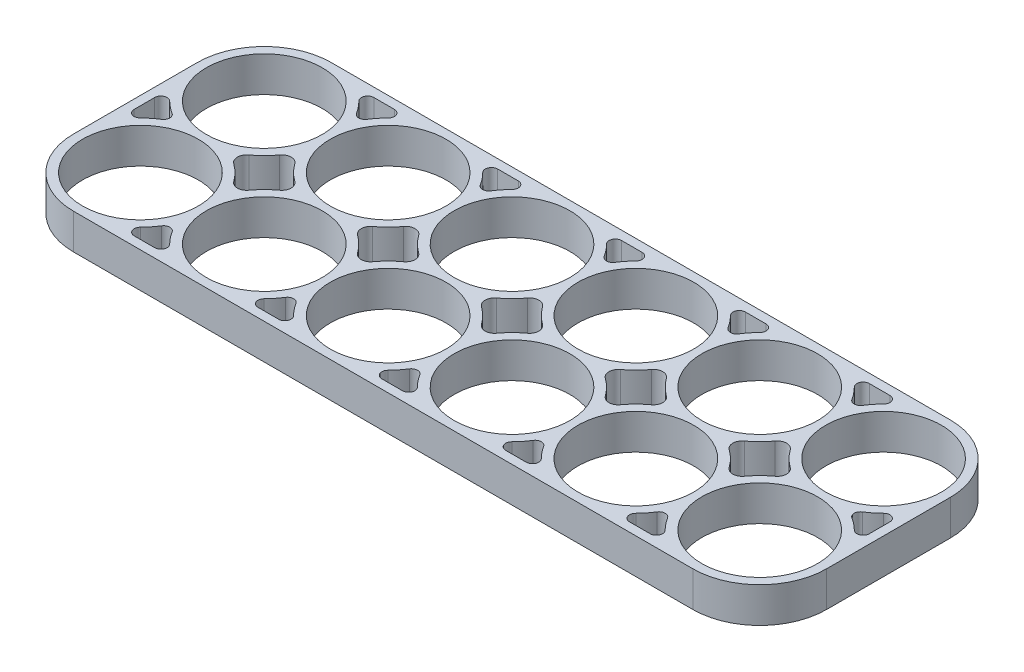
from build123d import *

# Parameters (mm, degrees)
SKIZZE1_R                       = 9.35
AUFSATZ_LINEAR_AUSTRAGEN1_DEPTH = 5.7


with BuildPart() as part:
    # Skizze1 → Aufsatz-Linear austragen1 (new body)
    with BuildSketch(Plane(origin=(0, 0, 0), x_dir=(1, 0, 0), z_dir=(0, 1, 0))):
        with BuildLine():
            Line((-60.8, 10), (-60.8, -10))
            ThreePointArc((-60.8, -10), (-57.636753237, -17.636753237), (-50, -20.8))
            Line((-50, -20.8), (50, -20.8))
            ThreePointArc((50, -20.8), (57.636753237, -17.636753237), (60.8, -10))
            Line((60.8, -10), (60.8, 10))
            ThreePointArc((60.8, 10), (57.636753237, 17.636753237), (50, 20.8))
            Line((50, 20.8), (-50, 20.8))
            ThreePointArc((-50, 20.8), (-57.636753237, 17.636753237), (-60.8, 10))
        make_face()
        with Locations(Location((-50, 10, 0), (0, 0, 270))):
            Circle(SKIZZE1_R, mode=Mode.SUBTRACT)
        with Locations(Location((-30, 10, 0), (0, 0, 270))):
            Circle(SKIZZE1_R, mode=Mode.SUBTRACT)
        with Locations(Location((-10, 10, 0), (0, 0, 270))):
            Circle(SKIZZE1_R, mode=Mode.SUBTRACT)
        with Locations(Location((10, 10, 0), (0, 0, 270))):
            Circle(SKIZZE1_R, mode=Mode.SUBTRACT)
        with Locations(Location((30, 10, 0), (0, 0, 270))):
            Circle(SKIZZE1_R, mode=Mode.SUBTRACT)
        with Locations(Location((50, 10, 0), (0, 0, 270))):
            Circle(SKIZZE1_R, mode=Mode.SUBTRACT)
        with Locations(Location((50, -10, 0), (0, 0, 270))):
            Circle(SKIZZE1_R, mode=Mode.SUBTRACT)
        with Locations(Location((30, -10, 0), (0, 0, 270))):
            Circle(SKIZZE1_R, mode=Mode.SUBTRACT)
        with Locations(Location((10, -10, 0), (0, 0, 270))):
            Circle(SKIZZE1_R, mode=Mode.SUBTRACT)
        with Locations(Location((-10, -10, 0), (0, 0, 270))):
            Circle(SKIZZE1_R, mode=Mode.SUBTRACT)
        with Locations(Location((-30, -10, 0), (0, 0, 270))):
            Circle(SKIZZE1_R, mode=Mode.SUBTRACT)
        with Locations(Location((-50, -10, 0), (0, 0, 270))):
            Circle(SKIZZE1_R, mode=Mode.SUBTRACT)
        with BuildLine():
            Line((-21.662284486, -19.35), (-18.337715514, -19.35))
            ThreePointArc((-18.337715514, -19.35), (-17.41369519, -18.732343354), (-17.631129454, -17.642372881))
            ThreePointArc((-17.631129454, -17.642372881), (-18.445947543, -16.730970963), (-19.152542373, -15.733320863))
            ThreePointArc((-19.152542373, -15.733320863), (-20, -15.264183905), (-20.847457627, -15.733320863))
            ThreePointArc((-20.847457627, -15.733320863), (-21.554052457, -16.730970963), (-22.368870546, -17.642372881))
            ThreePointArc((-22.368870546, -17.642372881), (-22.58630481, -18.732343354), (-21.662284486, -19.35))
        make_face(mode=Mode.SUBTRACT)
        with BuildLine():
            Line((-1.662284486, -19.35), (1.662284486, -19.35))
            ThreePointArc((1.662284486, -19.35), (2.58630481, -18.732343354), (2.368870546, -17.642372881))
            ThreePointArc((2.368870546, -17.642372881), (1.554052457, -16.730970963), (0.847457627, -15.733320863))
            ThreePointArc((0.847457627, -15.733320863), (0, -15.264183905), (-0.847457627, -15.733320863))
            ThreePointArc((-0.847457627, -15.733320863), (-1.554052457, -16.730970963), (-2.368870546, -17.642372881))
            ThreePointArc((-2.368870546, -17.642372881), (-2.58630481, -18.732343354), (-1.662284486, -19.35))
        make_face(mode=Mode.SUBTRACT)
        with BuildLine():
            Line((-59.35, -1.662284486), (-59.35, 1.662284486))
            ThreePointArc((-59.35, 1.662284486), (-58.732343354, 2.58630481), (-57.642372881, 2.368870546))
            ThreePointArc((-57.642372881, 2.368870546), (-56.730970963, 1.554052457), (-55.733320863, 0.847457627))
            ThreePointArc((-55.733320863, 0.847457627), (-55.264183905, 0), (-55.733320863, -0.847457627))
            ThreePointArc((-55.733320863, -0.847457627), (-56.730970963, -1.554052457), (-57.642372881, -2.368870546))
            ThreePointArc((-57.642372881, -2.368870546), (-58.732343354, -2.58630481), (-59.35, -1.662284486))
        make_face(mode=Mode.SUBTRACT)
        with BuildLine():
            Line((-41.662284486, -19.35), (-38.337715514, -19.35))
            ThreePointArc((-38.337715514, -19.35), (-37.41369519, -18.732343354), (-37.631129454, -17.642372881))
            ThreePointArc((-37.631129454, -17.642372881), (-38.445947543, -16.730970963), (-39.152542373, -15.733320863))
            ThreePointArc((-39.152542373, -15.733320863), (-40, -15.264183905), (-40.847457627, -15.733320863))
            ThreePointArc((-40.847457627, -15.733320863), (-41.554052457, -16.730970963), (-42.368870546, -17.642372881))
            ThreePointArc((-42.368870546, -17.642372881), (-42.58630481, -18.732343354), (-41.662284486, -19.35))
        make_face(mode=Mode.SUBTRACT)
        with BuildLine():
            Line((18.337715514, -19.35), (21.662284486, -19.35))
            ThreePointArc((21.662284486, -19.35), (22.58630481, -18.732343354), (22.368870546, -17.642372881))
            ThreePointArc((22.368870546, -17.642372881), (21.554052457, -16.730970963), (20.847457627, -15.733320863))
            ThreePointArc((20.847457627, -15.733320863), (20, -15.264183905), (19.152542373, -15.733320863))
            ThreePointArc((19.152542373, -15.733320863), (18.445947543, -16.730970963), (17.631129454, -17.642372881))
            ThreePointArc((17.631129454, -17.642372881), (17.41369519, -18.732343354), (18.337715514, -19.35))
        make_face(mode=Mode.SUBTRACT)
        with BuildLine():
            Line((38.337715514, -19.35), (41.662284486, -19.35))
            ThreePointArc((41.662284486, -19.35), (42.58630481, -18.732343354), (42.368870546, -17.642372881))
            ThreePointArc((42.368870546, -17.642372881), (41.554052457, -16.730970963), (40.847457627, -15.733320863))
            ThreePointArc((40.847457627, -15.733320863), (40, -15.264183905), (39.152542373, -15.733320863))
            ThreePointArc((39.152542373, -15.733320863), (38.445947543, -16.730970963), (37.631129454, -17.642372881))
            ThreePointArc((37.631129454, -17.642372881), (37.41369519, -18.732343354), (38.337715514, -19.35))
        make_face(mode=Mode.SUBTRACT)
        with BuildLine():
            Line((59.35, -1.662284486), (59.35, 1.662284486))
            ThreePointArc((59.35, 1.662284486), (58.732343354, 2.58630481), (57.642372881, 2.368870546))
            ThreePointArc((57.642372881, 2.368870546), (56.730970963, 1.554052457), (55.733320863, 0.847457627))
            ThreePointArc((55.733320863, 0.847457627), (55.264183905, 0), (55.733320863, -0.847457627))
            ThreePointArc((55.733320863, -0.847457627), (56.730970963, -1.554052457), (57.642372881, -2.368870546))
            ThreePointArc((57.642372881, -2.368870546), (58.732343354, -2.58630481), (59.35, -1.662284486))
        make_face(mode=Mode.SUBTRACT)
        with BuildLine():
            Line((-41.662284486, 19.35), (-38.337715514, 19.35))
            ThreePointArc((-38.337715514, 19.35), (-37.41369519, 18.732343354), (-37.631129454, 17.642372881))
            ThreePointArc((-37.631129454, 17.642372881), (-38.445947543, 16.730970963), (-39.152542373, 15.733320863))
            ThreePointArc((-39.152542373, 15.733320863), (-40, 15.264183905), (-40.847457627, 15.733320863))
            ThreePointArc((-40.847457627, 15.733320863), (-41.554052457, 16.730970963), (-42.368870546, 17.642372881))
            ThreePointArc((-42.368870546, 17.642372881), (-42.58630481, 18.732343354), (-41.662284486, 19.35))
        make_face(mode=Mode.SUBTRACT)
        with BuildLine():
            Line((-21.662284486, 19.35), (-18.337715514, 19.35))
            ThreePointArc((-18.337715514, 19.35), (-17.41369519, 18.732343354), (-17.631129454, 17.642372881))
            ThreePointArc((-17.631129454, 17.642372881), (-18.445947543, 16.730970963), (-19.152542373, 15.733320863))
            ThreePointArc((-19.152542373, 15.733320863), (-20, 15.264183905), (-20.847457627, 15.733320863))
            ThreePointArc((-20.847457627, 15.733320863), (-21.554052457, 16.730970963), (-22.368870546, 17.642372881))
            ThreePointArc((-22.368870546, 17.642372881), (-22.58630481, 18.732343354), (-21.662284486, 19.35))
        make_face(mode=Mode.SUBTRACT)
        with BuildLine():
            Line((-1.662284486, 19.35), (1.662284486, 19.35))
            ThreePointArc((1.662284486, 19.35), (2.58630481, 18.732343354), (2.368870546, 17.642372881))
            ThreePointArc((2.368870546, 17.642372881), (1.554052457, 16.730970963), (0.847457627, 15.733320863))
            ThreePointArc((0.847457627, 15.733320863), (0, 15.264183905), (-0.847457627, 15.733320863))
            ThreePointArc((-0.847457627, 15.733320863), (-1.554052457, 16.730970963), (-2.368870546, 17.642372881))
            ThreePointArc((-2.368870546, 17.642372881), (-2.58630481, 18.732343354), (-1.662284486, 19.35))
        make_face(mode=Mode.SUBTRACT)
        with BuildLine():
            Line((18.337715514, 19.35), (21.662284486, 19.35))
            ThreePointArc((21.662284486, 19.35), (22.58630481, 18.732343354), (22.368870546, 17.642372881))
            ThreePointArc((22.368870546, 17.642372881), (21.554052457, 16.730970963), (20.847457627, 15.733320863))
            ThreePointArc((20.847457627, 15.733320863), (20, 15.264183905), (19.152542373, 15.733320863))
            ThreePointArc((19.152542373, 15.733320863), (18.445947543, 16.730970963), (17.631129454, 17.642372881))
            ThreePointArc((17.631129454, 17.642372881), (17.41369519, 18.732343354), (18.337715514, 19.35))
        make_face(mode=Mode.SUBTRACT)
        with BuildLine():
            Line((38.337715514, 19.35), (41.662284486, 19.35))
            ThreePointArc((41.662284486, 19.35), (42.58630481, 18.732343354), (42.368870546, 17.642372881))
            ThreePointArc((42.368870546, 17.642372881), (41.554052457, 16.730970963), (40.847457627, 15.733320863))
            ThreePointArc((40.847457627, 15.733320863), (40, 15.264183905), (39.152542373, 15.733320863))
            ThreePointArc((39.152542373, 15.733320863), (38.445947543, 16.730970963), (37.631129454, 17.642372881))
            ThreePointArc((37.631129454, 17.642372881), (37.41369519, 18.732343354), (38.337715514, 19.35))
        make_face(mode=Mode.SUBTRACT)
        with BuildLine():
            ThreePointArc((-38.780487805, 3.711674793), (-37.636753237, 2.363246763), (-36.288325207, 1.219512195))
            ThreePointArc((-36.288325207, 1.219512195), (-35.661703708, 0), (-36.288325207, -1.219512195))
            ThreePointArc((-36.288325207, -1.219512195), (-37.636753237, -2.363246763), (-38.780487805, -3.711674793))
            ThreePointArc((-38.780487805, -3.711674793), (-40, -4.338296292), (-41.219512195, -3.711674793))
            ThreePointArc((-41.219512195, -3.711674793), (-42.363246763, -2.363246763), (-43.711674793, -1.219512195))
            ThreePointArc((-43.711674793, -1.219512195), (-44.338296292, 0), (-43.711674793, 1.219512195))
            ThreePointArc((-43.711674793, 1.219512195), (-42.363246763, 2.363246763), (-41.219512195, 3.711674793))
            ThreePointArc((-41.219512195, 3.711674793), (-40, 4.338296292), (-38.780487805, 3.711674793))
        make_face(mode=Mode.SUBTRACT)
        with BuildLine():
            ThreePointArc((-18.780487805, 3.711674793), (-17.636753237, 2.363246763), (-16.288325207, 1.219512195))
            ThreePointArc((-16.288325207, 1.219512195), (-15.661703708, 0), (-16.288325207, -1.219512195))
            ThreePointArc((-16.288325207, -1.219512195), (-17.636753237, -2.363246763), (-18.780487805, -3.711674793))
            ThreePointArc((-18.780487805, -3.711674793), (-20, -4.338296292), (-21.219512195, -3.711674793))
            ThreePointArc((-21.219512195, -3.711674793), (-22.363246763, -2.363246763), (-23.711674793, -1.219512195))
            ThreePointArc((-23.711674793, -1.219512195), (-24.338296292, 0), (-23.711674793, 1.219512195))
            ThreePointArc((-23.711674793, 1.219512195), (-22.363246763, 2.363246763), (-21.219512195, 3.711674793))
            ThreePointArc((-21.219512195, 3.711674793), (-20, 4.338296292), (-18.780487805, 3.711674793))
        make_face(mode=Mode.SUBTRACT)
        with BuildLine():
            ThreePointArc((1.219512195, 3.711674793), (2.363246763, 2.363246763), (3.711674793, 1.219512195))
            ThreePointArc((3.711674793, 1.219512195), (4.338296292, 0), (3.711674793, -1.219512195))
            ThreePointArc((3.711674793, -1.219512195), (2.363246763, -2.363246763), (1.219512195, -3.711674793))
            ThreePointArc((1.219512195, -3.711674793), (0, -4.338296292), (-1.219512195, -3.711674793))
            ThreePointArc((-1.219512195, -3.711674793), (-2.363246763, -2.363246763), (-3.711674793, -1.219512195))
            ThreePointArc((-3.711674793, -1.219512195), (-4.338296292, 0), (-3.711674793, 1.219512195))
            ThreePointArc((-3.711674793, 1.219512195), (-2.363246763, 2.363246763), (-1.219512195, 3.711674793))
            ThreePointArc((-1.219512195, 3.711674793), (0, 4.338296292), (1.219512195, 3.711674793))
        make_face(mode=Mode.SUBTRACT)
        with BuildLine():
            ThreePointArc((21.219512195, 3.711674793), (22.363246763, 2.363246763), (23.711674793, 1.219512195))
            ThreePointArc((23.711674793, 1.219512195), (24.338296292, 0), (23.711674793, -1.219512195))
            ThreePointArc((23.711674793, -1.219512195), (22.363246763, -2.363246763), (21.219512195, -3.711674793))
            ThreePointArc((21.219512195, -3.711674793), (20, -4.338296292), (18.780487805, -3.711674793))
            ThreePointArc((18.780487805, -3.711674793), (17.636753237, -2.363246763), (16.288325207, -1.219512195))
            ThreePointArc((16.288325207, -1.219512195), (15.661703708, 0), (16.288325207, 1.219512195))
            ThreePointArc((16.288325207, 1.219512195), (17.636753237, 2.363246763), (18.780487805, 3.711674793))
            ThreePointArc((18.780487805, 3.711674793), (20, 4.338296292), (21.219512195, 3.711674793))
        make_face(mode=Mode.SUBTRACT)
        with BuildLine():
            ThreePointArc((41.219512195, 3.711674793), (42.363246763, 2.363246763), (43.711674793, 1.219512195))
            ThreePointArc((43.711674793, 1.219512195), (44.338296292, 0), (43.711674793, -1.219512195))
            ThreePointArc((43.711674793, -1.219512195), (42.363246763, -2.363246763), (41.219512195, -3.711674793))
            ThreePointArc((41.219512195, -3.711674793), (40, -4.338296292), (38.780487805, -3.711674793))
            ThreePointArc((38.780487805, -3.711674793), (37.636753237, -2.363246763), (36.288325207, -1.219512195))
            ThreePointArc((36.288325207, -1.219512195), (35.661703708, 0), (36.288325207, 1.219512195))
            ThreePointArc((36.288325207, 1.219512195), (37.636753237, 2.363246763), (38.780487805, 3.711674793))
            ThreePointArc((38.780487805, 3.711674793), (40, 4.338296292), (41.219512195, 3.711674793))
        make_face(mode=Mode.SUBTRACT)
    extrude(amount=AUFSATZ_LINEAR_AUSTRAGEN1_DEPTH)


solid = part.part
